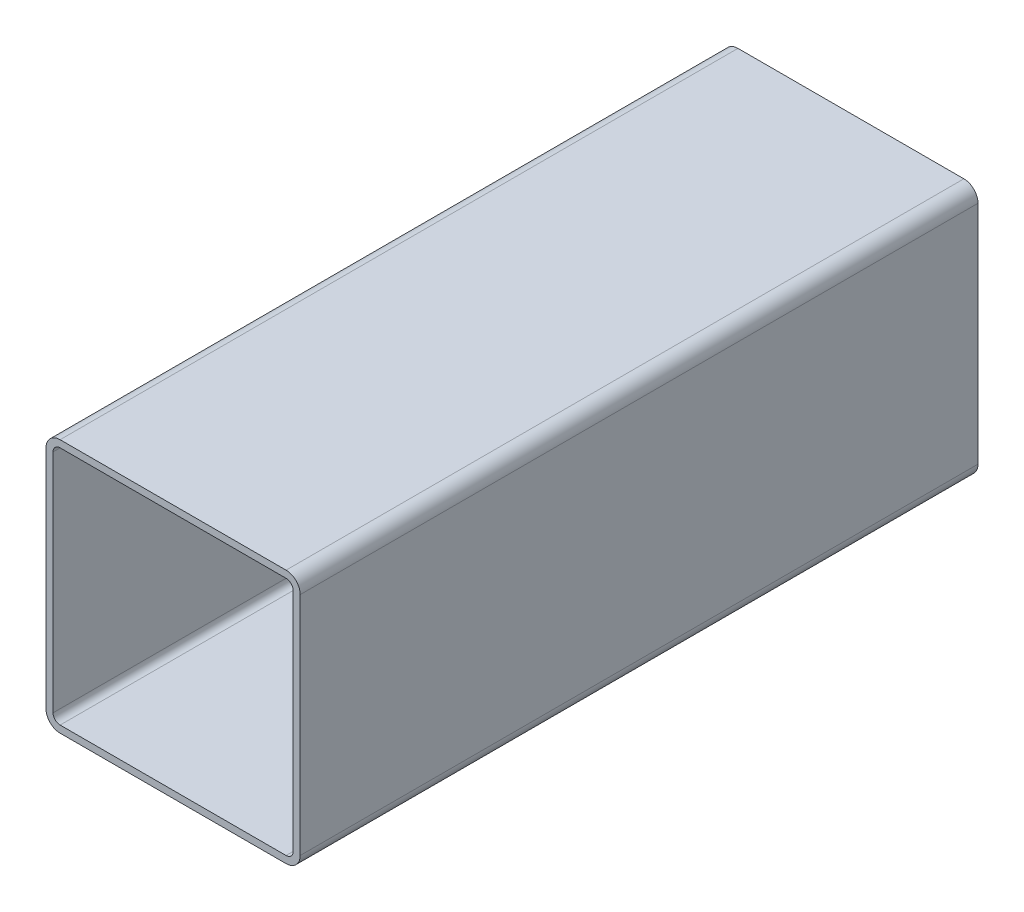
ISO-10303-21;
HEADER;
FILE_DESCRIPTION(('STEP AP214'),'2;1');
FILE_NAME('part.step','',(''),(''),'','','');
FILE_SCHEMA(('AUTOMOTIVE_DESIGN { 1 0 10303 214 1 1 1 1 }'));
ENDSEC;
DATA;
#1=APPLICATION_CONTEXT('core data for automotive mechanical design processes');
#2=APPLICATION_PROTOCOL_DEFINITION('international standard','automotive_design',2000,#1);
#3=PRODUCT_CONTEXT('',#1,'mechanical');
#4=PRODUCT('Part','Part','',(#3));
#5=PRODUCT_RELATED_PRODUCT_CATEGORY('part','',(#4));
#6=PRODUCT_DEFINITION_FORMATION('','',#4);
#7=PRODUCT_DEFINITION_CONTEXT('part definition',#1,'design');
#8=PRODUCT_DEFINITION('design','',#6,#7);
#9=PRODUCT_DEFINITION_SHAPE('','',#8);
#10=(LENGTH_UNIT() NAMED_UNIT(*) SI_UNIT(.MILLI.,.METRE.));
#11=(NAMED_UNIT(*) PLANE_ANGLE_UNIT() SI_UNIT($,.RADIAN.));
#12=(NAMED_UNIT(*) SI_UNIT($,.STERADIAN.) SOLID_ANGLE_UNIT());
#13=UNCERTAINTY_MEASURE_WITH_UNIT(LENGTH_MEASURE(1.E-05),#10,'distance_accuracy_value','');
#14=(GEOMETRIC_REPRESENTATION_CONTEXT(3) GLOBAL_UNCERTAINTY_ASSIGNED_CONTEXT((#13)) GLOBAL_UNIT_ASSIGNED_CONTEXT((#10,
#11,#12)) REPRESENTATION_CONTEXT('',''));
#15=CARTESIAN_POINT('',(0.,0.,0.));
#16=DIRECTION('',(0.,0.,1.));
#17=DIRECTION('',(1.,0.,0.));
#18=AXIS2_PLACEMENT_3D('',#15,#16,#17);
#19=CARTESIAN_POINT('',(7.61820871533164,108.728601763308,304.8));
#20=DIRECTION('',(0.,0.,1.));
#21=DIRECTION('',(1.,0.,0.));
#22=AXIS2_PLACEMENT_3D('',#19,#20,#21);
#23=PLANE('',#22);
#24=CARTESIAN_POINT('',(7.61820871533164,108.728601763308,304.8));
#25=DIRECTION('',(0.,0.,1.));
#26=DIRECTION('',(1.,0.,0.));
#27=AXIS2_PLACEMENT_3D('',#24,#25,#26);
#28=CIRCLE('',#27,6.35);
#29=CARTESIAN_POINT('',(7.61820871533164,115.078601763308,304.8));
#30=VERTEX_POINT('',#29);
#31=CARTESIAN_POINT('',(1.26820871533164,108.728601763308,304.8));
#32=VERTEX_POINT('',#31);
#33=EDGE_CURVE('E211',#30,#32,#28,.T.);
#34=ORIENTED_EDGE('',*,*,#33,.T.);
#35=DIRECTION('',(0.,-1.,0.));
#36=VECTOR('',#35,1.);
#37=CARTESIAN_POINT('',(1.26820871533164,7.12860176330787,304.8));
#38=LINE('',#37,#36);
#39=CARTESIAN_POINT('',(1.26820871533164,7.12860176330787,304.8));
#40=VERTEX_POINT('',#39);
#41=EDGE_CURVE('E214',#32,#40,#38,.T.);
#42=ORIENTED_EDGE('',*,*,#41,.T.);
#43=CARTESIAN_POINT('',(7.61820871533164,7.12860176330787,304.8));
#44=DIRECTION('',(0.,0.,1.));
#45=DIRECTION('',(1.,0.,0.));
#46=AXIS2_PLACEMENT_3D('',#43,#44,#45);
#47=CIRCLE('',#46,6.35);
#48=CARTESIAN_POINT('',(7.61820871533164,0.77860176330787,304.8));
#49=VERTEX_POINT('',#48);
#50=EDGE_CURVE('E217',#40,#49,#47,.T.);
#51=ORIENTED_EDGE('',*,*,#50,.T.);
#52=DIRECTION('',(1.,0.,0.));
#53=VECTOR('',#52,1.);
#54=CARTESIAN_POINT('',(109.218208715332,0.77860176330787,304.8));
#55=LINE('',#54,#53);
#56=CARTESIAN_POINT('',(109.218208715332,0.778601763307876,304.8));
#57=VERTEX_POINT('',#56);
#58=EDGE_CURVE('E219',#49,#57,#55,.T.);
#59=ORIENTED_EDGE('',*,*,#58,.T.);
#60=CARTESIAN_POINT('',(109.218208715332,7.12860176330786,304.8));
#61=DIRECTION('',(0.,0.,1.));
#62=DIRECTION('',(1.,0.,0.));
#63=AXIS2_PLACEMENT_3D('',#60,#61,#62);
#64=CIRCLE('',#63,6.34999999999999);
#65=CARTESIAN_POINT('',(115.568208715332,7.12860176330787,304.8));
#66=VERTEX_POINT('',#65);
#67=EDGE_CURVE('E221',#57,#66,#64,.T.);
#68=ORIENTED_EDGE('',*,*,#67,.T.);
#69=DIRECTION('',(0.,1.,0.));
#70=VECTOR('',#69,1.);
#71=CARTESIAN_POINT('',(115.568208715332,108.728601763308,304.8));
#72=LINE('',#71,#70);
#73=CARTESIAN_POINT('',(115.568208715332,108.728601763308,304.8));
#74=VERTEX_POINT('',#73);
#75=EDGE_CURVE('E223',#66,#74,#72,.T.);
#76=ORIENTED_EDGE('',*,*,#75,.T.);
#77=CARTESIAN_POINT('',(109.218208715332,108.728601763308,304.8));
#78=DIRECTION('',(0.,0.,1.));
#79=DIRECTION('',(1.,0.,0.));
#80=AXIS2_PLACEMENT_3D('',#77,#78,#79);
#81=CIRCLE('',#80,6.34999999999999);
#82=CARTESIAN_POINT('',(109.218208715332,115.078601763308,304.8));
#83=VERTEX_POINT('',#82);
#84=EDGE_CURVE('E225',#74,#83,#81,.T.);
#85=ORIENTED_EDGE('',*,*,#84,.T.);
#86=DIRECTION('',(-1.,0.,0.));
#87=VECTOR('',#86,1.);
#88=CARTESIAN_POINT('',(7.61820871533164,115.078601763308,304.8));
#89=LINE('',#88,#87);
#90=EDGE_CURVE('E227',#83,#30,#89,.T.);
#91=ORIENTED_EDGE('',*,*,#90,.T.);
#92=EDGE_LOOP('',(#34,#42,#51,#59,#68,#76,#85,#91));
#93=FACE_BOUND('',#92,.T.);
#94=DIRECTION('',(0.,-1.,0.));
#95=VECTOR('',#94,1.);
#96=CARTESIAN_POINT('',(4.44320871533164,7.12860176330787,304.8));
#97=LINE('',#96,#95);
#98=CARTESIAN_POINT('',(4.44320871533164,108.728601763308,304.8));
#99=VERTEX_POINT('',#98);
#100=CARTESIAN_POINT('',(4.44320871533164,7.12860176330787,304.8));
#101=VERTEX_POINT('',#100);
#102=EDGE_CURVE('E154',#99,#101,#97,.T.);
#103=ORIENTED_EDGE('',*,*,#102,.F.);
#104=CARTESIAN_POINT('',(7.61820871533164,108.728601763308,304.8));
#105=DIRECTION('',(0.,0.,1.));
#106=DIRECTION('',(1.,0.,0.));
#107=AXIS2_PLACEMENT_3D('',#104,#105,#106);
#108=CIRCLE('',#107,3.17500000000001);
#109=CARTESIAN_POINT('',(7.61820871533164,111.903601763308,304.8));
#110=VERTEX_POINT('',#109);
#111=EDGE_CURVE('E146',#110,#99,#108,.T.);
#112=ORIENTED_EDGE('',*,*,#111,.F.);
#113=DIRECTION('',(-1.,0.,0.));
#114=VECTOR('',#113,1.);
#115=CARTESIAN_POINT('',(7.61820871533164,111.903601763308,304.8));
#116=LINE('',#115,#114);
#117=CARTESIAN_POINT('',(109.218208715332,111.903601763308,304.8));
#118=VERTEX_POINT('',#117);
#119=EDGE_CURVE('E179',#118,#110,#116,.T.);
#120=ORIENTED_EDGE('',*,*,#119,.F.);
#121=CARTESIAN_POINT('',(109.218208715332,108.728601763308,304.8));
#122=DIRECTION('',(0.,0.,1.));
#123=DIRECTION('',(1.,0.,0.));
#124=AXIS2_PLACEMENT_3D('',#121,#122,#123);
#125=CIRCLE('',#124,3.17499999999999);
#126=CARTESIAN_POINT('',(112.393208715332,108.728601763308,304.8));
#127=VERTEX_POINT('',#126);
#128=EDGE_CURVE('E177',#127,#118,#125,.T.);
#129=ORIENTED_EDGE('',*,*,#128,.F.);
#130=DIRECTION('',(0.,1.,0.));
#131=VECTOR('',#130,1.);
#132=CARTESIAN_POINT('',(112.393208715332,108.728601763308,304.8));
#133=LINE('',#132,#131);
#134=CARTESIAN_POINT('',(112.393208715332,7.12860176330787,304.8));
#135=VERTEX_POINT('',#134);
#136=EDGE_CURVE('E175',#135,#127,#133,.T.);
#137=ORIENTED_EDGE('',*,*,#136,.F.);
#138=CARTESIAN_POINT('',(109.218208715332,7.12860176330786,304.8));
#139=DIRECTION('',(0.,0.,1.));
#140=DIRECTION('',(1.,0.,0.));
#141=AXIS2_PLACEMENT_3D('',#138,#139,#140);
#142=CIRCLE('',#141,3.17499999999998);
#143=CARTESIAN_POINT('',(109.218208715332,3.95360176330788,304.8));
#144=VERTEX_POINT('',#143);
#145=EDGE_CURVE('E173',#144,#135,#142,.T.);
#146=ORIENTED_EDGE('',*,*,#145,.F.);
#147=DIRECTION('',(1.,0.,0.));
#148=VECTOR('',#147,1.);
#149=CARTESIAN_POINT('',(109.218208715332,3.95360176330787,304.8));
#150=LINE('',#149,#148);
#151=CARTESIAN_POINT('',(7.61820871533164,3.95360176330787,304.8));
#152=VERTEX_POINT('',#151);
#153=EDGE_CURVE('E169',#152,#144,#150,.T.);
#154=ORIENTED_EDGE('',*,*,#153,.F.);
#155=CARTESIAN_POINT('',(7.61820871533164,7.12860176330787,304.8));
#156=DIRECTION('',(0.,0.,1.));
#157=DIRECTION('',(1.,0.,0.));
#158=AXIS2_PLACEMENT_3D('',#155,#156,#157);
#159=CIRCLE('',#158,3.175);
#160=EDGE_CURVE('E167',#101,#152,#159,.T.);
#161=ORIENTED_EDGE('',*,*,#160,.F.);
#162=EDGE_LOOP('',(#103,#112,#120,#129,#137,#146,#154,#161));
#163=FACE_BOUND('',#162,.T.);
#164=ADVANCED_FACE('F33',(#93,#163),#23,.T.);
#165=CARTESIAN_POINT('',(7.61820871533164,108.728601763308,0.));
#166=DIRECTION('',(0.,0.,1.));
#167=DIRECTION('',(1.,0.,0.));
#168=AXIS2_PLACEMENT_3D('',#165,#166,#167);
#169=PLANE('',#168);
#170=CARTESIAN_POINT('',(7.61820871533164,108.728601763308,0.));
#171=DIRECTION('',(0.,0.,1.));
#172=DIRECTION('',(1.,0.,0.));
#173=AXIS2_PLACEMENT_3D('',#170,#171,#172);
#174=CIRCLE('',#173,6.35);
#175=CARTESIAN_POINT('',(7.61820871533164,115.078601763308,0.));
#176=VERTEX_POINT('',#175);
#177=CARTESIAN_POINT('',(1.26820871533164,108.728601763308,0.));
#178=VERTEX_POINT('',#177);
#179=EDGE_CURVE('E162',#176,#178,#174,.T.);
#180=ORIENTED_EDGE('',*,*,#179,.F.);
#181=DIRECTION('',(-1.,0.,0.));
#182=VECTOR('',#181,1.);
#183=CARTESIAN_POINT('',(7.61820871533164,115.078601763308,0.));
#184=LINE('',#183,#182);
#185=CARTESIAN_POINT('',(109.218208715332,115.078601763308,0.));
#186=VERTEX_POINT('',#185);
#187=EDGE_CURVE('E215',#186,#176,#184,.T.);
#188=ORIENTED_EDGE('',*,*,#187,.F.);
#189=CARTESIAN_POINT('',(109.218208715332,108.728601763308,0.));
#190=DIRECTION('',(0.,0.,1.));
#191=DIRECTION('',(1.,0.,0.));
#192=AXIS2_PLACEMENT_3D('',#189,#190,#191);
#193=CIRCLE('',#192,6.34999999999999);
#194=CARTESIAN_POINT('',(115.568208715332,108.728601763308,0.));
#195=VERTEX_POINT('',#194);
#196=EDGE_CURVE('E242',#195,#186,#193,.T.);
#197=ORIENTED_EDGE('',*,*,#196,.F.);
#198=DIRECTION('',(0.,1.,0.));
#199=VECTOR('',#198,1.);
#200=CARTESIAN_POINT('',(115.568208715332,108.728601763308,0.));
#201=LINE('',#200,#199);
#202=CARTESIAN_POINT('',(115.568208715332,7.12860176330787,0.));
#203=VERTEX_POINT('',#202);
#204=EDGE_CURVE('E240',#203,#195,#201,.T.);
#205=ORIENTED_EDGE('',*,*,#204,.F.);
#206=CARTESIAN_POINT('',(109.218208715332,7.12860176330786,0.));
#207=DIRECTION('',(0.,0.,1.));
#208=DIRECTION('',(1.,0.,0.));
#209=AXIS2_PLACEMENT_3D('',#206,#207,#208);
#210=CIRCLE('',#209,6.34999999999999);
#211=CARTESIAN_POINT('',(109.218208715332,0.778601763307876,0.));
#212=VERTEX_POINT('',#211);
#213=EDGE_CURVE('E238',#212,#203,#210,.T.);
#214=ORIENTED_EDGE('',*,*,#213,.F.);
#215=DIRECTION('',(1.,0.,0.));
#216=VECTOR('',#215,1.);
#217=CARTESIAN_POINT('',(109.218208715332,0.77860176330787,0.));
#218=LINE('',#217,#216);
#219=CARTESIAN_POINT('',(7.61820871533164,0.77860176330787,0.));
#220=VERTEX_POINT('',#219);
#221=EDGE_CURVE('E236',#220,#212,#218,.T.);
#222=ORIENTED_EDGE('',*,*,#221,.F.);
#223=CARTESIAN_POINT('',(7.61820871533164,7.12860176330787,0.));
#224=DIRECTION('',(0.,0.,1.));
#225=DIRECTION('',(1.,0.,0.));
#226=AXIS2_PLACEMENT_3D('',#223,#224,#225);
#227=CIRCLE('',#226,6.35);
#228=CARTESIAN_POINT('',(1.26820871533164,7.12860176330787,0.));
#229=VERTEX_POINT('',#228);
#230=EDGE_CURVE('E234',#229,#220,#227,.T.);
#231=ORIENTED_EDGE('',*,*,#230,.F.);
#232=DIRECTION('',(0.,-1.,0.));
#233=VECTOR('',#232,1.);
#234=CARTESIAN_POINT('',(1.26820871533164,7.12860176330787,0.));
#235=LINE('',#234,#233);
#236=EDGE_CURVE('E232',#178,#229,#235,.T.);
#237=ORIENTED_EDGE('',*,*,#236,.F.);
#238=EDGE_LOOP('',(#180,#188,#197,#205,#214,#222,#231,#237));
#239=FACE_BOUND('',#238,.T.);
#240=CARTESIAN_POINT('',(7.61820871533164,108.728601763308,0.));
#241=DIRECTION('',(0.,0.,1.));
#242=DIRECTION('',(1.,0.,0.));
#243=AXIS2_PLACEMENT_3D('',#240,#241,#242);
#244=CIRCLE('',#243,3.17500000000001);
#245=CARTESIAN_POINT('',(7.61820871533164,111.903601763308,0.));
#246=VERTEX_POINT('',#245);
#247=CARTESIAN_POINT('',(4.44320871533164,108.728601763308,0.));
#248=VERTEX_POINT('',#247);
#249=EDGE_CURVE('E56',#246,#248,#244,.T.);
#250=ORIENTED_EDGE('',*,*,#249,.T.);
#251=DIRECTION('',(0.,-1.,0.));
#252=VECTOR('',#251,1.);
#253=CARTESIAN_POINT('',(4.44320871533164,7.12860176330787,0.));
#254=LINE('',#253,#252);
#255=CARTESIAN_POINT('',(4.44320871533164,7.12860176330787,0.));
#256=VERTEX_POINT('',#255);
#257=EDGE_CURVE('E161',#248,#256,#254,.T.);
#258=ORIENTED_EDGE('',*,*,#257,.T.);
#259=CARTESIAN_POINT('',(7.61820871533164,7.12860176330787,0.));
#260=DIRECTION('',(0.,0.,1.));
#261=DIRECTION('',(1.,0.,0.));
#262=AXIS2_PLACEMENT_3D('',#259,#260,#261);
#263=CIRCLE('',#262,3.175);
#264=CARTESIAN_POINT('',(7.61820871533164,3.95360176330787,0.));
#265=VERTEX_POINT('',#264);
#266=EDGE_CURVE('E183',#256,#265,#263,.T.);
#267=ORIENTED_EDGE('',*,*,#266,.T.);
#268=DIRECTION('',(1.,0.,0.));
#269=VECTOR('',#268,1.);
#270=CARTESIAN_POINT('',(109.218208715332,3.95360176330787,0.));
#271=LINE('',#270,#269);
#272=CARTESIAN_POINT('',(109.218208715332,3.95360176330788,0.));
#273=VERTEX_POINT('',#272);
#274=EDGE_CURVE('E186',#265,#273,#271,.T.);
#275=ORIENTED_EDGE('',*,*,#274,.T.);
#276=CARTESIAN_POINT('',(109.218208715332,7.12860176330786,0.));
#277=DIRECTION('',(0.,0.,1.));
#278=DIRECTION('',(1.,0.,0.));
#279=AXIS2_PLACEMENT_3D('',#276,#277,#278);
#280=CIRCLE('',#279,3.17499999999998);
#281=CARTESIAN_POINT('',(112.393208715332,7.12860176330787,0.));
#282=VERTEX_POINT('',#281);
#283=EDGE_CURVE('E189',#273,#282,#280,.T.);
#284=ORIENTED_EDGE('',*,*,#283,.T.);
#285=DIRECTION('',(0.,1.,0.));
#286=VECTOR('',#285,1.);
#287=CARTESIAN_POINT('',(112.393208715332,108.728601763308,0.));
#288=LINE('',#287,#286);
#289=CARTESIAN_POINT('',(112.393208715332,108.728601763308,0.));
#290=VERTEX_POINT('',#289);
#291=EDGE_CURVE('E192',#282,#290,#288,.T.);
#292=ORIENTED_EDGE('',*,*,#291,.T.);
#293=CARTESIAN_POINT('',(109.218208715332,108.728601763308,0.));
#294=DIRECTION('',(0.,0.,1.));
#295=DIRECTION('',(1.,0.,0.));
#296=AXIS2_PLACEMENT_3D('',#293,#294,#295);
#297=CIRCLE('',#296,3.17499999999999);
#298=CARTESIAN_POINT('',(109.218208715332,111.903601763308,0.));
#299=VERTEX_POINT('',#298);
#300=EDGE_CURVE('E195',#290,#299,#297,.T.);
#301=ORIENTED_EDGE('',*,*,#300,.T.);
#302=DIRECTION('',(-1.,0.,0.));
#303=VECTOR('',#302,1.);
#304=CARTESIAN_POINT('',(7.61820871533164,111.903601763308,0.));
#305=LINE('',#304,#303);
#306=EDGE_CURVE('E155',#299,#246,#305,.T.);
#307=ORIENTED_EDGE('',*,*,#306,.T.);
#308=EDGE_LOOP('',(#250,#258,#267,#275,#284,#292,#301,#307));
#309=FACE_BOUND('',#308,.T.);
#310=ADVANCED_FACE('F272',(#239,#309),#169,.F.);
#311=CARTESIAN_POINT('',(7.61820871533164,108.728601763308,304.8));
#312=DIRECTION('',(0.,0.,-1.));
#313=DIRECTION('',(-1.,0.,0.));
#314=AXIS2_PLACEMENT_3D('',#311,#312,#313);
#315=CYLINDRICAL_SURFACE('',#314,6.35);
#316=ORIENTED_EDGE('',*,*,#179,.T.);
#317=DIRECTION('',(0.,0.,-1.));
#318=VECTOR('',#317,1.);
#319=CARTESIAN_POINT('',(1.26820871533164,108.728601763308,304.8));
#320=LINE('',#319,#318);
#321=EDGE_CURVE('E11',#32,#178,#320,.T.);
#322=ORIENTED_EDGE('',*,*,#321,.F.);
#323=ORIENTED_EDGE('',*,*,#33,.F.);
#324=DIRECTION('',(0.,0.,-1.));
#325=VECTOR('',#324,1.);
#326=CARTESIAN_POINT('',(7.61820871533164,115.078601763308,304.8));
#327=LINE('',#326,#325);
#328=EDGE_CURVE('E229',#30,#176,#327,.T.);
#329=ORIENTED_EDGE('',*,*,#328,.T.);
#330=EDGE_LOOP('',(#316,#322,#323,#329));
#331=FACE_BOUND('',#330,.T.);
#332=ADVANCED_FACE('F35',(#331),#315,.T.);
#333=CARTESIAN_POINT('',(1.26820871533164,7.12860176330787,304.8));
#334=DIRECTION('',(1.,0.,0.));
#335=DIRECTION('',(0.,0.,-1.));
#336=AXIS2_PLACEMENT_3D('',#333,#334,#335);
#337=PLANE('',#336);
#338=ORIENTED_EDGE('',*,*,#236,.T.);
#339=DIRECTION('',(0.,0.,-1.));
#340=VECTOR('',#339,1.);
#341=CARTESIAN_POINT('',(1.26820871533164,7.12860176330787,304.8));
#342=LINE('',#341,#340);
#343=EDGE_CURVE('E41',#40,#229,#342,.T.);
#344=ORIENTED_EDGE('',*,*,#343,.F.);
#345=ORIENTED_EDGE('',*,*,#41,.F.);
#346=ORIENTED_EDGE('',*,*,#321,.T.);
#347=EDGE_LOOP('',(#338,#344,#345,#346));
#348=FACE_BOUND('',#347,.T.);
#349=ADVANCED_FACE('F289',(#348),#337,.F.);
#350=CARTESIAN_POINT('',(7.61820871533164,7.12860176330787,304.8));
#351=DIRECTION('',(0.,0.,-1.));
#352=DIRECTION('',(-1.,0.,0.));
#353=AXIS2_PLACEMENT_3D('',#350,#351,#352);
#354=CYLINDRICAL_SURFACE('',#353,6.35);
#355=ORIENTED_EDGE('',*,*,#230,.T.);
#356=DIRECTION('',(0.,0.,-1.));
#357=VECTOR('',#356,1.);
#358=CARTESIAN_POINT('',(7.61820871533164,0.77860176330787,304.8));
#359=LINE('',#358,#357);
#360=EDGE_CURVE('E259',#49,#220,#359,.T.);
#361=ORIENTED_EDGE('',*,*,#360,.F.);
#362=ORIENTED_EDGE('',*,*,#50,.F.);
#363=ORIENTED_EDGE('',*,*,#343,.T.);
#364=EDGE_LOOP('',(#355,#361,#362,#363));
#365=FACE_BOUND('',#364,.T.);
#366=ADVANCED_FACE('F266',(#365),#354,.T.);
#367=CARTESIAN_POINT('',(109.218208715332,0.77860176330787,304.8));
#368=DIRECTION('',(0.,1.,0.));
#369=DIRECTION('',(0.,0.,1.));
#370=AXIS2_PLACEMENT_3D('',#367,#368,#369);
#371=PLANE('',#370);
#372=ORIENTED_EDGE('',*,*,#221,.T.);
#373=DIRECTION('',(0.,0.,-1.));
#374=VECTOR('',#373,1.);
#375=CARTESIAN_POINT('',(109.218208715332,0.778601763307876,304.8));
#376=LINE('',#375,#374);
#377=EDGE_CURVE('E256',#57,#212,#376,.T.);
#378=ORIENTED_EDGE('',*,*,#377,.F.);
#379=ORIENTED_EDGE('',*,*,#58,.F.);
#380=ORIENTED_EDGE('',*,*,#360,.T.);
#381=EDGE_LOOP('',(#372,#378,#379,#380));
#382=FACE_BOUND('',#381,.T.);
#383=ADVANCED_FACE('F278',(#382),#371,.F.);
#384=CARTESIAN_POINT('',(109.218208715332,7.12860176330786,304.8));
#385=DIRECTION('',(0.,0.,-1.));
#386=DIRECTION('',(-1.,0.,0.));
#387=AXIS2_PLACEMENT_3D('',#384,#385,#386);
#388=CYLINDRICAL_SURFACE('',#387,6.34999999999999);
#389=ORIENTED_EDGE('',*,*,#213,.T.);
#390=DIRECTION('',(0.,0.,-1.));
#391=VECTOR('',#390,1.);
#392=CARTESIAN_POINT('',(115.568208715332,7.12860176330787,304.8));
#393=LINE('',#392,#391);
#394=EDGE_CURVE('E253',#66,#203,#393,.T.);
#395=ORIENTED_EDGE('',*,*,#394,.F.);
#396=ORIENTED_EDGE('',*,*,#67,.F.);
#397=ORIENTED_EDGE('',*,*,#377,.T.);
#398=EDGE_LOOP('',(#389,#395,#396,#397));
#399=FACE_BOUND('',#398,.T.);
#400=ADVANCED_FACE('F282',(#399),#388,.T.);
#401=CARTESIAN_POINT('',(115.568208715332,108.728601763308,304.8));
#402=DIRECTION('',(-1.,0.,0.));
#403=DIRECTION('',(0.,0.,1.));
#404=AXIS2_PLACEMENT_3D('',#401,#402,#403);
#405=PLANE('',#404);
#406=ORIENTED_EDGE('',*,*,#204,.T.);
#407=DIRECTION('',(0.,0.,-1.));
#408=VECTOR('',#407,1.);
#409=CARTESIAN_POINT('',(115.568208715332,108.728601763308,304.8));
#410=LINE('',#409,#408);
#411=EDGE_CURVE('E250',#74,#195,#410,.T.);
#412=ORIENTED_EDGE('',*,*,#411,.F.);
#413=ORIENTED_EDGE('',*,*,#75,.F.);
#414=ORIENTED_EDGE('',*,*,#394,.T.);
#415=EDGE_LOOP('',(#406,#412,#413,#414));
#416=FACE_BOUND('',#415,.T.);
#417=ADVANCED_FACE('F302',(#416),#405,.F.);
#418=CARTESIAN_POINT('',(109.218208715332,108.728601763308,304.8));
#419=DIRECTION('',(0.,0.,-1.));
#420=DIRECTION('',(-1.,0.,0.));
#421=AXIS2_PLACEMENT_3D('',#418,#419,#420);
#422=CYLINDRICAL_SURFACE('',#421,6.34999999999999);
#423=ORIENTED_EDGE('',*,*,#196,.T.);
#424=DIRECTION('',(0.,0.,-1.));
#425=VECTOR('',#424,1.);
#426=CARTESIAN_POINT('',(109.218208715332,115.078601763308,304.8));
#427=LINE('',#426,#425);
#428=EDGE_CURVE('E247',#83,#186,#427,.T.);
#429=ORIENTED_EDGE('',*,*,#428,.F.);
#430=ORIENTED_EDGE('',*,*,#84,.F.);
#431=ORIENTED_EDGE('',*,*,#411,.T.);
#432=EDGE_LOOP('',(#423,#429,#430,#431));
#433=FACE_BOUND('',#432,.T.);
#434=ADVANCED_FACE('F300',(#433),#422,.T.);
#435=CARTESIAN_POINT('',(7.61820871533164,115.078601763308,304.8));
#436=DIRECTION('',(0.,-1.,0.));
#437=DIRECTION('',(0.,0.,-1.));
#438=AXIS2_PLACEMENT_3D('',#435,#436,#437);
#439=PLANE('',#438);
#440=ORIENTED_EDGE('',*,*,#187,.T.);
#441=ORIENTED_EDGE('',*,*,#328,.F.);
#442=ORIENTED_EDGE('',*,*,#90,.F.);
#443=ORIENTED_EDGE('',*,*,#428,.T.);
#444=EDGE_LOOP('',(#440,#441,#442,#443));
#445=FACE_BOUND('',#444,.T.);
#446=ADVANCED_FACE('F295',(#445),#439,.F.);
#447=CARTESIAN_POINT('',(7.61820871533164,108.728601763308,304.8));
#448=DIRECTION('',(0.,0.,-1.));
#449=DIRECTION('',(-1.,0.,0.));
#450=AXIS2_PLACEMENT_3D('',#447,#448,#449);
#451=CYLINDRICAL_SURFACE('',#450,3.17500000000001);
#452=ORIENTED_EDGE('',*,*,#249,.F.);
#453=DIRECTION('',(0.,0.,-1.));
#454=VECTOR('',#453,1.);
#455=CARTESIAN_POINT('',(7.61820871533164,111.903601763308,304.8));
#456=LINE('',#455,#454);
#457=EDGE_CURVE('E150',#110,#246,#456,.T.);
#458=ORIENTED_EDGE('',*,*,#457,.F.);
#459=ORIENTED_EDGE('',*,*,#111,.T.);
#460=DIRECTION('',(0.,0.,-1.));
#461=VECTOR('',#460,1.);
#462=CARTESIAN_POINT('',(4.44320871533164,108.728601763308,304.8));
#463=LINE('',#462,#461);
#464=EDGE_CURVE('E149',#99,#248,#463,.T.);
#465=ORIENTED_EDGE('',*,*,#464,.T.);
#466=EDGE_LOOP('',(#452,#458,#459,#465));
#467=FACE_BOUND('',#466,.T.);
#468=ADVANCED_FACE('F148',(#467),#451,.F.);
#469=CARTESIAN_POINT('',(4.44320871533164,7.12860176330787,304.8));
#470=DIRECTION('',(1.,0.,0.));
#471=DIRECTION('',(0.,0.,-1.));
#472=AXIS2_PLACEMENT_3D('',#469,#470,#471);
#473=PLANE('',#472);
#474=ORIENTED_EDGE('',*,*,#257,.F.);
#475=ORIENTED_EDGE('',*,*,#464,.F.);
#476=ORIENTED_EDGE('',*,*,#102,.T.);
#477=DIRECTION('',(0.,0.,-1.));
#478=VECTOR('',#477,1.);
#479=CARTESIAN_POINT('',(4.44320871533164,7.12860176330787,304.8));
#480=LINE('',#479,#478);
#481=EDGE_CURVE('E163',#101,#256,#480,.T.);
#482=ORIENTED_EDGE('',*,*,#481,.T.);
#483=EDGE_LOOP('',(#474,#475,#476,#482));
#484=FACE_BOUND('',#483,.T.);
#485=ADVANCED_FACE('F158',(#484),#473,.T.);
#486=CARTESIAN_POINT('',(7.61820871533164,7.12860176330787,304.8));
#487=DIRECTION('',(0.,0.,-1.));
#488=DIRECTION('',(-1.,0.,0.));
#489=AXIS2_PLACEMENT_3D('',#486,#487,#488);
#490=CYLINDRICAL_SURFACE('',#489,3.175);
#491=ORIENTED_EDGE('',*,*,#266,.F.);
#492=ORIENTED_EDGE('',*,*,#481,.F.);
#493=ORIENTED_EDGE('',*,*,#160,.T.);
#494=DIRECTION('',(0.,0.,-1.));
#495=VECTOR('',#494,1.);
#496=CARTESIAN_POINT('',(7.61820871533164,3.95360176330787,304.8));
#497=LINE('',#496,#495);
#498=EDGE_CURVE('E208',#152,#265,#497,.T.);
#499=ORIENTED_EDGE('',*,*,#498,.T.);
#500=EDGE_LOOP('',(#491,#492,#493,#499));
#501=FACE_BOUND('',#500,.T.);
#502=ADVANCED_FACE('F327',(#501),#490,.F.);
#503=CARTESIAN_POINT('',(109.218208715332,3.95360176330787,304.8));
#504=DIRECTION('',(0.,1.,0.));
#505=DIRECTION('',(0.,0.,1.));
#506=AXIS2_PLACEMENT_3D('',#503,#504,#505);
#507=PLANE('',#506);
#508=ORIENTED_EDGE('',*,*,#274,.F.);
#509=ORIENTED_EDGE('',*,*,#498,.F.);
#510=ORIENTED_EDGE('',*,*,#153,.T.);
#511=DIRECTION('',(0.,0.,-1.));
#512=VECTOR('',#511,1.);
#513=CARTESIAN_POINT('',(109.218208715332,3.95360176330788,304.8));
#514=LINE('',#513,#512);
#515=EDGE_CURVE('E206',#144,#273,#514,.T.);
#516=ORIENTED_EDGE('',*,*,#515,.T.);
#517=EDGE_LOOP('',(#508,#509,#510,#516));
#518=FACE_BOUND('',#517,.T.);
#519=ADVANCED_FACE('F331',(#518),#507,.T.);
#520=CARTESIAN_POINT('',(109.218208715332,7.12860176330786,304.8));
#521=DIRECTION('',(0.,0.,-1.));
#522=DIRECTION('',(-1.,0.,0.));
#523=AXIS2_PLACEMENT_3D('',#520,#521,#522);
#524=CYLINDRICAL_SURFACE('',#523,3.17499999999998);
#525=ORIENTED_EDGE('',*,*,#283,.F.);
#526=ORIENTED_EDGE('',*,*,#515,.F.);
#527=ORIENTED_EDGE('',*,*,#145,.T.);
#528=DIRECTION('',(0.,0.,-1.));
#529=VECTOR('',#528,1.);
#530=CARTESIAN_POINT('',(112.393208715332,7.12860176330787,304.8));
#531=LINE('',#530,#529);
#532=EDGE_CURVE('E204',#135,#282,#531,.T.);
#533=ORIENTED_EDGE('',*,*,#532,.T.);
#534=EDGE_LOOP('',(#525,#526,#527,#533));
#535=FACE_BOUND('',#534,.T.);
#536=ADVANCED_FACE('F337',(#535),#524,.F.);
#537=CARTESIAN_POINT('',(112.393208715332,108.728601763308,304.8));
#538=DIRECTION('',(-1.,0.,0.));
#539=DIRECTION('',(0.,0.,1.));
#540=AXIS2_PLACEMENT_3D('',#537,#538,#539);
#541=PLANE('',#540);
#542=ORIENTED_EDGE('',*,*,#291,.F.);
#543=ORIENTED_EDGE('',*,*,#532,.F.);
#544=ORIENTED_EDGE('',*,*,#136,.T.);
#545=DIRECTION('',(0.,0.,-1.));
#546=VECTOR('',#545,1.);
#547=CARTESIAN_POINT('',(112.393208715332,108.728601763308,304.8));
#548=LINE('',#547,#546);
#549=EDGE_CURVE('E202',#127,#290,#548,.T.);
#550=ORIENTED_EDGE('',*,*,#549,.T.);
#551=EDGE_LOOP('',(#542,#543,#544,#550));
#552=FACE_BOUND('',#551,.T.);
#553=ADVANCED_FACE('F341',(#552),#541,.T.);
#554=CARTESIAN_POINT('',(109.218208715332,108.728601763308,304.8));
#555=DIRECTION('',(0.,0.,-1.));
#556=DIRECTION('',(-1.,0.,0.));
#557=AXIS2_PLACEMENT_3D('',#554,#555,#556);
#558=CYLINDRICAL_SURFACE('',#557,3.17499999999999);
#559=ORIENTED_EDGE('',*,*,#300,.F.);
#560=ORIENTED_EDGE('',*,*,#549,.F.);
#561=ORIENTED_EDGE('',*,*,#128,.T.);
#562=DIRECTION('',(0.,0.,-1.));
#563=VECTOR('',#562,1.);
#564=CARTESIAN_POINT('',(109.218208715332,111.903601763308,304.8));
#565=LINE('',#564,#563);
#566=EDGE_CURVE('E48',#118,#299,#565,.T.);
#567=ORIENTED_EDGE('',*,*,#566,.T.);
#568=EDGE_LOOP('',(#559,#560,#561,#567));
#569=FACE_BOUND('',#568,.T.);
#570=ADVANCED_FACE('F345',(#569),#558,.F.);
#571=CARTESIAN_POINT('',(7.61820871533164,111.903601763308,304.8));
#572=DIRECTION('',(0.,-1.,0.));
#573=DIRECTION('',(0.,0.,-1.));
#574=AXIS2_PLACEMENT_3D('',#571,#572,#573);
#575=PLANE('',#574);
#576=ORIENTED_EDGE('',*,*,#306,.F.);
#577=ORIENTED_EDGE('',*,*,#566,.F.);
#578=ORIENTED_EDGE('',*,*,#119,.T.);
#579=ORIENTED_EDGE('',*,*,#457,.T.);
#580=EDGE_LOOP('',(#576,#577,#578,#579));
#581=FACE_BOUND('',#580,.T.);
#582=ADVANCED_FACE('F349',(#581),#575,.T.);
#583=CLOSED_SHELL('',(#164,#310,#332,#349,#366,#383,#400,#417,#434,#446,#468,#485,#502,#519,
#536,#553,#570,#582));
#584=MANIFOLD_SOLID_BREP('B2',#583);
#585=ADVANCED_BREP_SHAPE_REPRESENTATION('',(#18,#584),#14);
#586=SHAPE_DEFINITION_REPRESENTATION(#9,#585);
ENDSEC;
END-ISO-10303-21;
